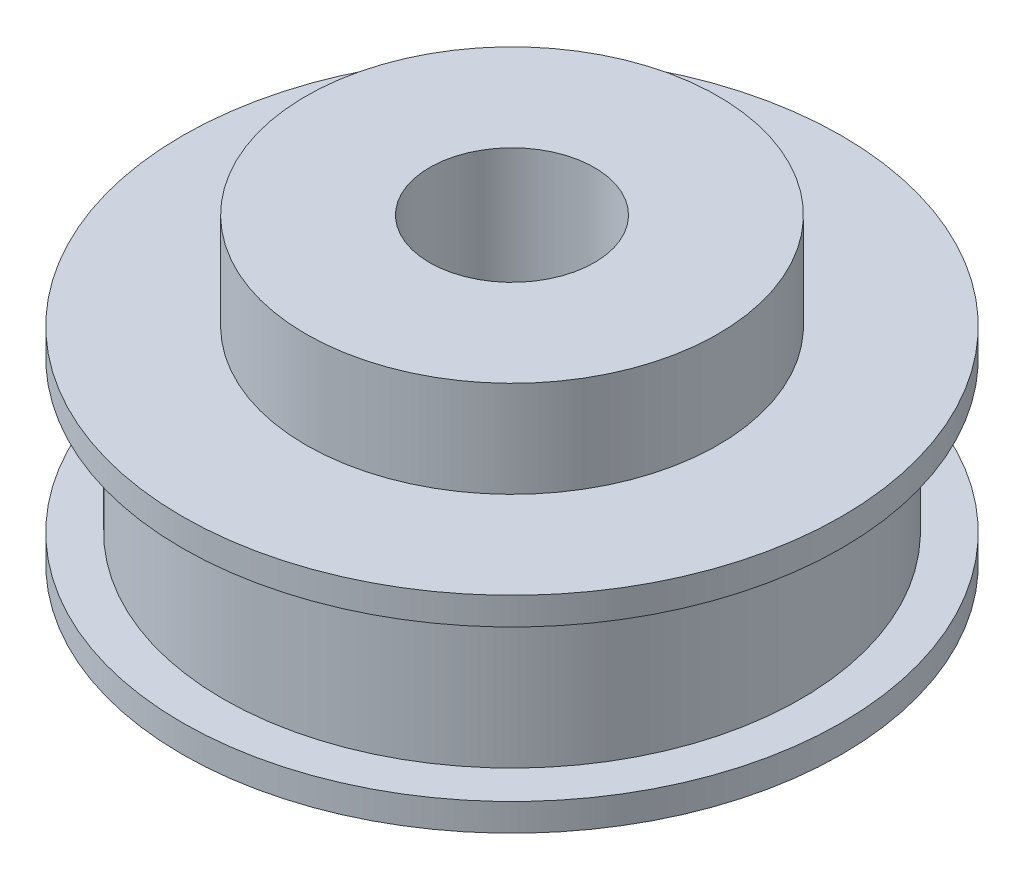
from build123d import *

# Parameters (mm, degrees)
CROQUIS1_R                         = 24
EXTRUIR1_DEPTH                     = 2
CROQUIS2_R                         = 21.02
EXTRUIR2_DEPTH                     = 11
CROQUIS3_R                         = 24
EXTRUIR3_DEPTH                     = 2
CROQUIS11_R                        = 15
EXTRUIR7_DEPTH                     = 7
TALADRO_DE_DI_METRO_DE_12_0_12_1_D = 12


with BuildPart() as part:
    # Croquis1 → Extruir1 (new body)
    with BuildSketch(Plane(origin=(0, 0, 0), x_dir=(1, 0, 0), z_dir=(0, 1, 0))):
        with Locations(Location((0, 0, 0), (0, 0, 270))):
            Circle(CROQUIS1_R)
    extrude(amount=EXTRUIR1_DEPTH)

    # Croquis2 → Extruir2 (add)
    with BuildSketch(Plane(origin=(0, 2, 0), x_dir=(1, 0, 0), z_dir=(0, 1, 0))):
        with Locations(Location((0, 0, 0), (0, 0, 270))):
            Circle(CROQUIS2_R)
    extrude(amount=EXTRUIR2_DEPTH)

    # Croquis3 → Extruir3 (add)
    with BuildSketch(Plane(origin=(0, 13, 0), x_dir=(1, 0, 0), z_dir=(0, 1, 0))):
        with Locations(Location((0, 0, 0), (0, 0, 270))):
            Circle(CROQUIS3_R)
    extrude(amount=EXTRUIR3_DEPTH)

    # Croquis11 → Extruir7 (add)
    with BuildSketch(Plane(origin=(0, 15, 0), x_dir=(1, 0, 0), z_dir=(0, 1, 0))):
        with Locations(Location((0, 0, 0), (0, 0, 270))):
            Circle(CROQUIS11_R)
    extrude(amount=EXTRUIR7_DEPTH)

    # Taladro de di_metro de _12.0 _12_1 (through all)
    with Locations(Plane.ZX.offset(22)):
        with Locations((0, 0)):
            Hole(TALADRO_DE_DI_METRO_DE_12_0_12_1_D / 2)


solid = part.part
